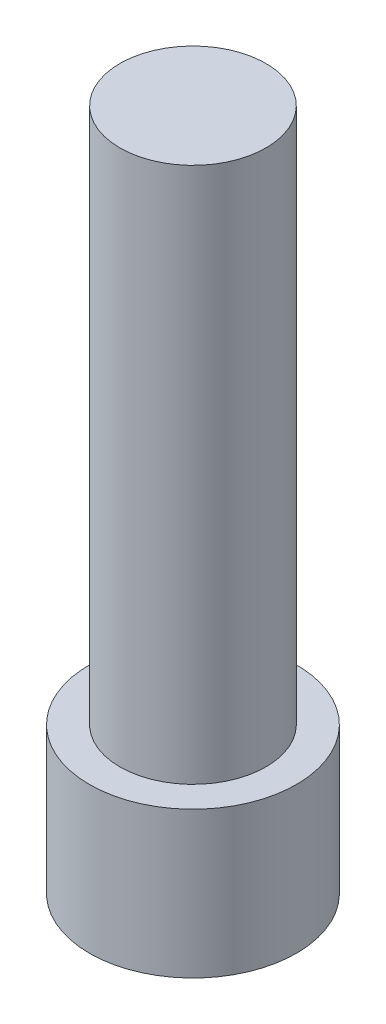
ISO-10303-21;
HEADER;
FILE_DESCRIPTION(('STEP AP214'),'2;1');
FILE_NAME('part.step','',(''),(''),'','','');
FILE_SCHEMA(('AUTOMOTIVE_DESIGN { 1 0 10303 214 1 1 1 1 }'));
ENDSEC;
DATA;
#1=APPLICATION_CONTEXT('core data for automotive mechanical design processes');
#2=APPLICATION_PROTOCOL_DEFINITION('international standard','automotive_design',2000,#1);
#3=PRODUCT_CONTEXT('',#1,'mechanical');
#4=PRODUCT('Part','Part','',(#3));
#5=PRODUCT_RELATED_PRODUCT_CATEGORY('part','',(#4));
#6=PRODUCT_DEFINITION_FORMATION('','',#4);
#7=PRODUCT_DEFINITION_CONTEXT('part definition',#1,'design');
#8=PRODUCT_DEFINITION('design','',#6,#7);
#9=PRODUCT_DEFINITION_SHAPE('','',#8);
#10=(LENGTH_UNIT() NAMED_UNIT(*) SI_UNIT(.MILLI.,.METRE.));
#11=(NAMED_UNIT(*) PLANE_ANGLE_UNIT() SI_UNIT($,.RADIAN.));
#12=(NAMED_UNIT(*) SI_UNIT($,.STERADIAN.) SOLID_ANGLE_UNIT());
#13=UNCERTAINTY_MEASURE_WITH_UNIT(LENGTH_MEASURE(1.E-05),#10,'distance_accuracy_value','');
#14=(GEOMETRIC_REPRESENTATION_CONTEXT(3) GLOBAL_UNCERTAINTY_ASSIGNED_CONTEXT((#13)) GLOBAL_UNIT_ASSIGNED_CONTEXT((#10,
#11,#12)) REPRESENTATION_CONTEXT('',''));
#15=CARTESIAN_POINT('',(0.,0.,0.));
#16=DIRECTION('',(0.,0.,1.));
#17=DIRECTION('',(1.,0.,0.));
#18=AXIS2_PLACEMENT_3D('',#15,#16,#17);
#19=CARTESIAN_POINT('',(0.,6.,0.));
#20=DIRECTION('',(0.,-1.,0.));
#21=DIRECTION('',(0.,0.,-1.));
#22=AXIS2_PLACEMENT_3D('',#19,#20,#21);
#23=CYLINDRICAL_SURFACE('',#22,4.25);
#24=CARTESIAN_POINT('',(0.,6.,0.));
#25=DIRECTION('',(0.,1.,0.));
#26=DIRECTION('',(0.,0.,1.));
#27=AXIS2_PLACEMENT_3D('',#24,#25,#26);
#28=CIRCLE('',#27,4.25);
#29=CARTESIAN_POINT('',(0.,6.,4.25));
#30=VERTEX_POINT('',#29);
#31=EDGE_CURVE('E51',#30,#30,#28,.T.);
#32=ORIENTED_EDGE('',*,*,#31,.F.);
#33=EDGE_LOOP('',(#32));
#34=FACE_BOUND('',#33,.T.);
#35=CARTESIAN_POINT('',(0.,0.,0.));
#36=DIRECTION('',(0.,1.,0.));
#37=DIRECTION('',(0.,0.,1.));
#38=AXIS2_PLACEMENT_3D('',#35,#36,#37);
#39=CIRCLE('',#38,4.25);
#40=CARTESIAN_POINT('',(0.,0.,4.25));
#41=VERTEX_POINT('',#40);
#42=EDGE_CURVE('E46',#41,#41,#39,.T.);
#43=ORIENTED_EDGE('',*,*,#42,.T.);
#44=EDGE_LOOP('',(#43));
#45=FACE_BOUND('',#44,.T.);
#46=ADVANCED_FACE('F43',(#34,#45),#23,.T.);
#47=CARTESIAN_POINT('',(0.,6.,0.));
#48=DIRECTION('',(0.,1.,0.));
#49=DIRECTION('',(0.,0.,1.));
#50=AXIS2_PLACEMENT_3D('',#47,#48,#49);
#51=PLANE('',#50);
#52=CARTESIAN_POINT('',(0.,6.,0.));
#53=DIRECTION('',(0.,1.,0.));
#54=DIRECTION('',(0.,0.,1.));
#55=AXIS2_PLACEMENT_3D('',#52,#53,#54);
#56=CIRCLE('',#55,3.);
#57=CARTESIAN_POINT('',(0.,6.,3.));
#58=VERTEX_POINT('',#57);
#59=EDGE_CURVE('E11',#58,#58,#56,.T.);
#60=ORIENTED_EDGE('',*,*,#59,.F.);
#61=EDGE_LOOP('',(#60));
#62=FACE_BOUND('',#61,.T.);
#63=ORIENTED_EDGE('',*,*,#31,.T.);
#64=EDGE_LOOP('',(#63));
#65=FACE_BOUND('',#64,.T.);
#66=ADVANCED_FACE('F161',(#62,#65),#51,.T.);
#67=CARTESIAN_POINT('',(0.,0.,0.));
#68=DIRECTION('',(0.,1.,0.));
#69=DIRECTION('',(0.,0.,1.));
#70=AXIS2_PLACEMENT_3D('',#67,#68,#69);
#71=PLANE('',#70);
#72=DIRECTION('',(0.091692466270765,0.,0.995787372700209));
#73=VECTOR('',#72,1.);
#74=CARTESIAN_POINT('',(2.3571217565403,0.,-1.66652643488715));
#75=LINE('',#74,#73);
#76=CARTESIAN_POINT('',(2.3571217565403,0.,-1.66652643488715));
#77=VERTEX_POINT('',#76);
#78=CARTESIAN_POINT('',(2.62181510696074,0.,1.20806410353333));
#79=VERTEX_POINT('',#78);
#80=EDGE_CURVE('E135',#77,#79,#75,.T.);
#81=ORIENTED_EDGE('',*,*,#80,.F.);
#82=DIRECTION('',(0.908223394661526,0.,0.418485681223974));
#83=VECTOR('',#82,1.);
#84=CARTESIAN_POINT('',(-0.264693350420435,0.,-2.87459053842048));
#85=LINE('',#84,#83);
#86=CARTESIAN_POINT('',(-0.264693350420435,0.,-2.87459053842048));
#87=VERTEX_POINT('',#86);
#88=EDGE_CURVE('E56',#87,#77,#85,.T.);
#89=ORIENTED_EDGE('',*,*,#88,.F.);
#90=DIRECTION('',(0.816530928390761,0.,-0.577301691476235));
#91=VECTOR('',#90,1.);
#92=CARTESIAN_POINT('',(-2.62181510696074,0.,-1.20806410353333));
#93=LINE('',#92,#91);
#94=CARTESIAN_POINT('',(-2.62181510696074,0.,-1.20806410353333));
#95=VERTEX_POINT('',#94);
#96=EDGE_CURVE('E145',#95,#87,#93,.T.);
#97=ORIENTED_EDGE('',*,*,#96,.F.);
#98=DIRECTION('',(-0.0916924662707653,0.,-0.995787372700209));
#99=VECTOR('',#98,1.);
#100=CARTESIAN_POINT('',(-2.3571217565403,0.,1.66652643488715));
#101=LINE('',#100,#99);
#102=CARTESIAN_POINT('',(-2.3571217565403,0.,1.66652643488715));
#103=VERTEX_POINT('',#102);
#104=EDGE_CURVE('E136',#103,#95,#101,.T.);
#105=ORIENTED_EDGE('',*,*,#104,.F.);
#106=DIRECTION('',(-0.908223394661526,0.,-0.418485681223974));
#107=VECTOR('',#106,1.);
#108=CARTESIAN_POINT('',(0.264693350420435,0.,2.87459053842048));
#109=LINE('',#108,#107);
#110=CARTESIAN_POINT('',(0.264693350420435,0.,2.87459053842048));
#111=VERTEX_POINT('',#110);
#112=EDGE_CURVE('E110',#111,#103,#109,.T.);
#113=ORIENTED_EDGE('',*,*,#112,.F.);
#114=DIRECTION('',(-0.816530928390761,0.,0.577301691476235));
#115=VECTOR('',#114,1.);
#116=CARTESIAN_POINT('',(2.62181510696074,0.,1.20806410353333));
#117=LINE('',#116,#115);
#118=EDGE_CURVE('E138',#79,#111,#117,.T.);
#119=ORIENTED_EDGE('',*,*,#118,.F.);
#120=EDGE_LOOP('',(#81,#89,#97,#105,#113,#119));
#121=FACE_BOUND('',#120,.T.);
#122=ORIENTED_EDGE('',*,*,#42,.F.);
#123=EDGE_LOOP('',(#122));
#124=FACE_BOUND('',#123,.T.);
#125=ADVANCED_FACE('F156',(#121,#124),#71,.F.);
#126=CARTESIAN_POINT('',(0.,28.,0.));
#127=DIRECTION('',(0.,-1.,0.));
#128=DIRECTION('',(0.,0.,-1.));
#129=AXIS2_PLACEMENT_3D('',#126,#127,#128);
#130=CYLINDRICAL_SURFACE('',#129,3.);
#131=CARTESIAN_POINT('',(0.,28.,0.));
#132=DIRECTION('',(0.,1.,0.));
#133=DIRECTION('',(0.,0.,1.));
#134=AXIS2_PLACEMENT_3D('',#131,#132,#133);
#135=CIRCLE('',#134,3.);
#136=CARTESIAN_POINT('',(0.,28.,3.));
#137=VERTEX_POINT('',#136);
#138=EDGE_CURVE('E147',#137,#137,#135,.T.);
#139=ORIENTED_EDGE('',*,*,#138,.F.);
#140=EDGE_LOOP('',(#139));
#141=FACE_BOUND('',#140,.T.);
#142=ORIENTED_EDGE('',*,*,#59,.T.);
#143=EDGE_LOOP('',(#142));
#144=FACE_BOUND('',#143,.T.);
#145=ADVANCED_FACE('F162',(#141,#144),#130,.T.);
#146=CARTESIAN_POINT('',(0.,28.,0.));
#147=DIRECTION('',(0.,1.,0.));
#148=DIRECTION('',(0.,0.,1.));
#149=AXIS2_PLACEMENT_3D('',#146,#147,#148);
#150=PLANE('',#149);
#151=ORIENTED_EDGE('',*,*,#138,.T.);
#152=EDGE_LOOP('',(#151));
#153=FACE_BOUND('',#152,.T.);
#154=ADVANCED_FACE('F167',(#153),#150,.T.);
#155=CARTESIAN_POINT('',(-0.264693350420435,3.,-2.87459053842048));
#156=DIRECTION('',(0.418485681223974,0.,-0.908223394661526));
#157=DIRECTION('',(-0.908223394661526,0.,-0.418485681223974));
#158=AXIS2_PLACEMENT_3D('',#155,#156,#157);
#159=PLANE('',#158);
#160=ORIENTED_EDGE('',*,*,#88,.T.);
#161=DIRECTION('',(0.,-1.,0.));
#162=VECTOR('',#161,1.);
#163=CARTESIAN_POINT('',(2.3571217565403,3.,-1.66652643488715));
#164=LINE('',#163,#162);
#165=CARTESIAN_POINT('',(2.3571217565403,3.,-1.66652643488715));
#166=VERTEX_POINT('',#165);
#167=EDGE_CURVE('E88',#166,#77,#164,.T.);
#168=ORIENTED_EDGE('',*,*,#167,.F.);
#169=DIRECTION('',(0.908223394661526,0.,0.418485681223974));
#170=VECTOR('',#169,1.);
#171=CARTESIAN_POINT('',(-0.264693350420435,3.,-2.87459053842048));
#172=LINE('',#171,#170);
#173=CARTESIAN_POINT('',(-0.264693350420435,3.,-2.87459053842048));
#174=VERTEX_POINT('',#173);
#175=EDGE_CURVE('E144',#174,#166,#172,.T.);
#176=ORIENTED_EDGE('',*,*,#175,.F.);
#177=DIRECTION('',(0.,-1.,0.));
#178=VECTOR('',#177,1.);
#179=CARTESIAN_POINT('',(-0.264693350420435,3.,-2.87459053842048));
#180=LINE('',#179,#178);
#181=EDGE_CURVE('E66',#174,#87,#180,.T.);
#182=ORIENTED_EDGE('',*,*,#181,.T.);
#183=EDGE_LOOP('',(#160,#168,#176,#182));
#184=FACE_BOUND('',#183,.T.);
#185=ADVANCED_FACE('F200',(#184),#159,.F.);
#186=CARTESIAN_POINT('',(-2.62181510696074,3.,-1.20806410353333));
#187=DIRECTION('',(-0.577301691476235,0.,-0.816530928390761));
#188=DIRECTION('',(-0.816530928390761,0.,0.577301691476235));
#189=AXIS2_PLACEMENT_3D('',#186,#187,#188);
#190=PLANE('',#189);
#191=ORIENTED_EDGE('',*,*,#96,.T.);
#192=ORIENTED_EDGE('',*,*,#181,.F.);
#193=DIRECTION('',(0.816530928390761,0.,-0.577301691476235));
#194=VECTOR('',#193,1.);
#195=CARTESIAN_POINT('',(-2.62181510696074,3.,-1.20806410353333));
#196=LINE('',#195,#194);
#197=CARTESIAN_POINT('',(-2.62181510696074,3.,-1.20806410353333));
#198=VERTEX_POINT('',#197);
#199=EDGE_CURVE('E118',#198,#174,#196,.T.);
#200=ORIENTED_EDGE('',*,*,#199,.F.);
#201=DIRECTION('',(0.,-1.,0.));
#202=VECTOR('',#201,1.);
#203=CARTESIAN_POINT('',(-2.62181510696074,3.,-1.20806410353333));
#204=LINE('',#203,#202);
#205=EDGE_CURVE('E111',#198,#95,#204,.T.);
#206=ORIENTED_EDGE('',*,*,#205,.T.);
#207=EDGE_LOOP('',(#191,#192,#200,#206));
#208=FACE_BOUND('',#207,.T.);
#209=ADVANCED_FACE('F208',(#208),#190,.F.);
#210=CARTESIAN_POINT('',(-2.3571217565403,3.,1.66652643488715));
#211=DIRECTION('',(-0.995787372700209,0.,0.0916924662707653));
#212=DIRECTION('',(0.0916924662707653,0.,0.995787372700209));
#213=AXIS2_PLACEMENT_3D('',#210,#211,#212);
#214=PLANE('',#213);
#215=ORIENTED_EDGE('',*,*,#104,.T.);
#216=ORIENTED_EDGE('',*,*,#205,.F.);
#217=DIRECTION('',(-0.0916924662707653,0.,-0.995787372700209));
#218=VECTOR('',#217,1.);
#219=CARTESIAN_POINT('',(-2.3571217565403,3.,1.66652643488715));
#220=LINE('',#219,#218);
#221=CARTESIAN_POINT('',(-2.3571217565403,3.,1.66652643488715));
#222=VERTEX_POINT('',#221);
#223=EDGE_CURVE('E114',#222,#198,#220,.T.);
#224=ORIENTED_EDGE('',*,*,#223,.F.);
#225=DIRECTION('',(0.,-1.,0.));
#226=VECTOR('',#225,1.);
#227=CARTESIAN_POINT('',(-2.3571217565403,3.,1.66652643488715));
#228=LINE('',#227,#226);
#229=EDGE_CURVE('E99',#222,#103,#228,.T.);
#230=ORIENTED_EDGE('',*,*,#229,.T.);
#231=EDGE_LOOP('',(#215,#216,#224,#230));
#232=FACE_BOUND('',#231,.T.);
#233=ADVANCED_FACE('F116',(#232),#214,.F.);
#234=CARTESIAN_POINT('',(0.264693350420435,3.,2.87459053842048));
#235=DIRECTION('',(-0.418485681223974,0.,0.908223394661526));
#236=DIRECTION('',(0.908223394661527,0.,0.418485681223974));
#237=AXIS2_PLACEMENT_3D('',#234,#235,#236);
#238=PLANE('',#237);
#239=ORIENTED_EDGE('',*,*,#112,.T.);
#240=ORIENTED_EDGE('',*,*,#229,.F.);
#241=DIRECTION('',(-0.908223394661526,0.,-0.418485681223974));
#242=VECTOR('',#241,1.);
#243=CARTESIAN_POINT('',(0.264693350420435,3.,2.87459053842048));
#244=LINE('',#243,#242);
#245=CARTESIAN_POINT('',(0.264693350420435,3.,2.87459053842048));
#246=VERTEX_POINT('',#245);
#247=EDGE_CURVE('E104',#246,#222,#244,.T.);
#248=ORIENTED_EDGE('',*,*,#247,.F.);
#249=DIRECTION('',(0.,-1.,0.));
#250=VECTOR('',#249,1.);
#251=CARTESIAN_POINT('',(0.264693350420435,3.,2.87459053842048));
#252=LINE('',#251,#250);
#253=EDGE_CURVE('E115',#246,#111,#252,.T.);
#254=ORIENTED_EDGE('',*,*,#253,.T.);
#255=EDGE_LOOP('',(#239,#240,#248,#254));
#256=FACE_BOUND('',#255,.T.);
#257=ADVANCED_FACE('F105',(#256),#238,.F.);
#258=CARTESIAN_POINT('',(2.62181510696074,3.,1.20806410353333));
#259=DIRECTION('',(0.577301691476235,0.,0.816530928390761));
#260=DIRECTION('',(0.816530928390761,0.,-0.577301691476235));
#261=AXIS2_PLACEMENT_3D('',#258,#259,#260);
#262=PLANE('',#261);
#263=ORIENTED_EDGE('',*,*,#118,.T.);
#264=ORIENTED_EDGE('',*,*,#253,.F.);
#265=DIRECTION('',(-0.816530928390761,0.,0.577301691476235));
#266=VECTOR('',#265,1.);
#267=CARTESIAN_POINT('',(2.62181510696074,3.,1.20806410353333));
#268=LINE('',#267,#266);
#269=CARTESIAN_POINT('',(2.62181510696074,3.,1.20806410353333));
#270=VERTEX_POINT('',#269);
#271=EDGE_CURVE('E123',#270,#246,#268,.T.);
#272=ORIENTED_EDGE('',*,*,#271,.F.);
#273=DIRECTION('',(0.,-1.,0.));
#274=VECTOR('',#273,1.);
#275=CARTESIAN_POINT('',(2.62181510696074,3.,1.20806410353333));
#276=LINE('',#275,#274);
#277=EDGE_CURVE('E146',#270,#79,#276,.T.);
#278=ORIENTED_EDGE('',*,*,#277,.T.);
#279=EDGE_LOOP('',(#263,#264,#272,#278));
#280=FACE_BOUND('',#279,.T.);
#281=ADVANCED_FACE('F232',(#280),#262,.F.);
#282=CARTESIAN_POINT('',(2.3571217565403,3.,-1.66652643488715));
#283=DIRECTION('',(0.995787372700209,0.,-0.091692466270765));
#284=DIRECTION('',(-0.091692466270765,0.,-0.995787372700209));
#285=AXIS2_PLACEMENT_3D('',#282,#283,#284);
#286=PLANE('',#285);
#287=ORIENTED_EDGE('',*,*,#80,.T.);
#288=ORIENTED_EDGE('',*,*,#277,.F.);
#289=DIRECTION('',(0.091692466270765,0.,0.995787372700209));
#290=VECTOR('',#289,1.);
#291=CARTESIAN_POINT('',(2.3571217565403,3.,-1.66652643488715));
#292=LINE('',#291,#290);
#293=EDGE_CURVE('E130',#166,#270,#292,.T.);
#294=ORIENTED_EDGE('',*,*,#293,.F.);
#295=ORIENTED_EDGE('',*,*,#167,.T.);
#296=EDGE_LOOP('',(#287,#288,#294,#295));
#297=FACE_BOUND('',#296,.T.);
#298=ADVANCED_FACE('F242',(#297),#286,.F.);
#299=CARTESIAN_POINT('',(0.,3.,0.));
#300=DIRECTION('',(0.,-1.,0.));
#301=DIRECTION('',(0.,0.,-1.));
#302=AXIS2_PLACEMENT_3D('',#299,#300,#301);
#303=PLANE('',#302);
#304=ORIENTED_EDGE('',*,*,#175,.T.);
#305=ORIENTED_EDGE('',*,*,#293,.T.);
#306=ORIENTED_EDGE('',*,*,#271,.T.);
#307=ORIENTED_EDGE('',*,*,#247,.T.);
#308=ORIENTED_EDGE('',*,*,#223,.T.);
#309=ORIENTED_EDGE('',*,*,#199,.T.);
#310=EDGE_LOOP('',(#304,#305,#306,#307,#308,#309));
#311=FACE_BOUND('',#310,.T.);
#312=ADVANCED_FACE('F125',(#311),#303,.T.);
#313=CLOSED_SHELL('',(#46,#66,#125,#145,#154,#185,#209,#233,#257,#281,#298,#312));
#314=MANIFOLD_SOLID_BREP('B2',#313);
#315=ADVANCED_BREP_SHAPE_REPRESENTATION('',(#18,#314),#14);
#316=SHAPE_DEFINITION_REPRESENTATION(#9,#315);
ENDSEC;
END-ISO-10303-21;
